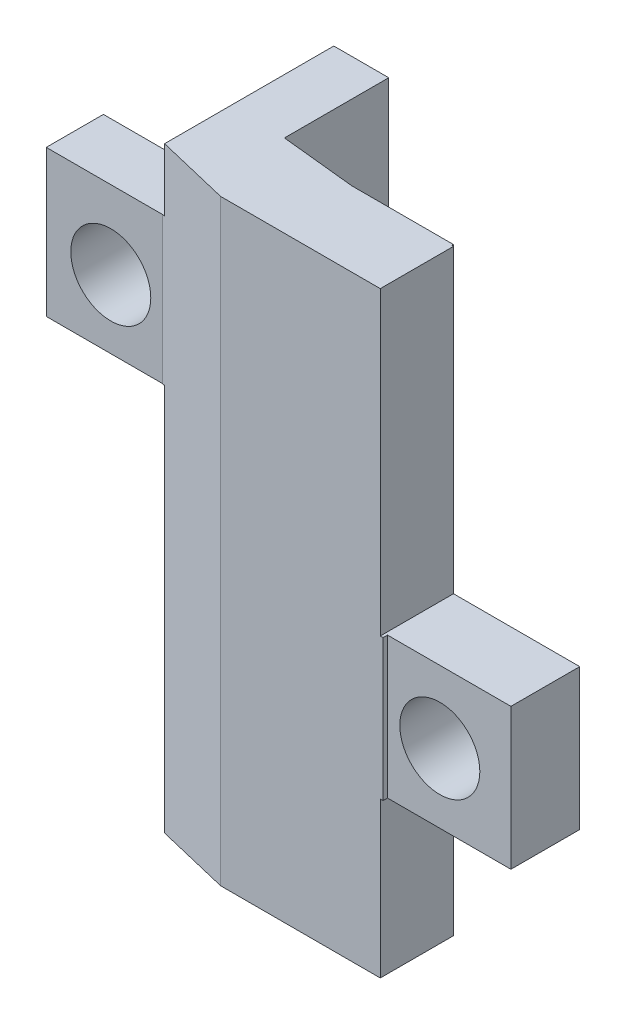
ISO-10303-21;
HEADER;
FILE_DESCRIPTION(('STEP AP214'),'2;1');
FILE_NAME('part.step','',(''),(''),'','','');
FILE_SCHEMA(('AUTOMOTIVE_DESIGN { 1 0 10303 214 1 1 1 1 }'));
ENDSEC;
DATA;
#1=APPLICATION_CONTEXT('core data for automotive mechanical design processes');
#2=APPLICATION_PROTOCOL_DEFINITION('international standard','automotive_design',2000,#1);
#3=PRODUCT_CONTEXT('',#1,'mechanical');
#4=PRODUCT('Part','Part','',(#3));
#5=PRODUCT_RELATED_PRODUCT_CATEGORY('part','',(#4));
#6=PRODUCT_DEFINITION_FORMATION('','',#4);
#7=PRODUCT_DEFINITION_CONTEXT('part definition',#1,'design');
#8=PRODUCT_DEFINITION('design','',#6,#7);
#9=PRODUCT_DEFINITION_SHAPE('','',#8);
#10=(LENGTH_UNIT() NAMED_UNIT(*) SI_UNIT(.MILLI.,.METRE.));
#11=(NAMED_UNIT(*) PLANE_ANGLE_UNIT() SI_UNIT($,.RADIAN.));
#12=(NAMED_UNIT(*) SI_UNIT($,.STERADIAN.) SOLID_ANGLE_UNIT());
#13=UNCERTAINTY_MEASURE_WITH_UNIT(LENGTH_MEASURE(1.E-05),#10,'distance_accuracy_value','');
#14=(GEOMETRIC_REPRESENTATION_CONTEXT(3) GLOBAL_UNCERTAINTY_ASSIGNED_CONTEXT((#13)) GLOBAL_UNIT_ASSIGNED_CONTEXT((#10,
#11,#12)) REPRESENTATION_CONTEXT('',''));
#15=CARTESIAN_POINT('',(0.,0.,0.));
#16=DIRECTION('',(0.,0.,1.));
#17=DIRECTION('',(1.,0.,0.));
#18=AXIS2_PLACEMENT_3D('',#15,#16,#17);
#19=CARTESIAN_POINT('',(44.1667326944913,-18.8400478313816,18.1256266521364));
#20=DIRECTION('',(-0.000195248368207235,0.,0.999999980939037));
#21=DIRECTION('',(0.999999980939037,0.,0.000195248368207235));
#22=AXIS2_PLACEMENT_3D('',#19,#20,#21);
#23=CYLINDRICAL_SURFACE('',#22,1.39999999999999);
#24=CARTESIAN_POINT('',(44.1640294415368,-18.8400478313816,31.970827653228));
#25=DIRECTION('',(0.,0.,-1.));
#26=DIRECTION('',(-1.,0.,0.));
#27=AXIS2_PLACEMENT_3D('',#24,#25,#26);
#28=ELLIPSE('',#27,1.40000002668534,1.39999999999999);
#29=CARTESIAN_POINT('',(42.7640294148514,-18.8400478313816,31.970827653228));
#30=VERTEX_POINT('',#29);
#31=EDGE_CURVE('E352',#30,#30,#28,.T.);
#32=ORIENTED_EDGE('',*,*,#31,.F.);
#33=EDGE_LOOP('',(#32));
#34=FACE_BOUND('',#33,.T.);
#35=CARTESIAN_POINT('',(44.1644998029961,-18.8400478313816,29.5617860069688));
#36=DIRECTION('',(0.,0.,-1.));
#37=DIRECTION('',(-1.,0.,0.));
#38=AXIS2_PLACEMENT_3D('',#35,#36,#37);
#39=ELLIPSE('',#38,1.40000002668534,1.39999999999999);
#40=CARTESIAN_POINT('',(42.7644997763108,-18.8400478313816,29.5617860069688));
#41=VERTEX_POINT('',#40);
#42=EDGE_CURVE('E222',#41,#41,#39,.F.);
#43=ORIENTED_EDGE('',*,*,#42,.F.);
#44=EDGE_LOOP('',(#43));
#45=FACE_BOUND('',#44,.T.);
#46=ADVANCED_FACE('F39',(#34,#45),#23,.F.);
#47=CARTESIAN_POINT('',(42.2362085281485,-16.3206117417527,18.1252497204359));
#48=DIRECTION('',(0.,1.,0.));
#49=DIRECTION('',(0.,0.,1.));
#50=AXIS2_PLACEMENT_3D('',#47,#48,#49);
#51=PLANE('',#50);
#52=DIRECTION('',(-0.000195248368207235,0.,0.999999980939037));
#53=VECTOR('',#52,1.);
#54=CARTESIAN_POINT('',(46.6549716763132,-16.3206117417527,18.1261124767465));
#55=LINE('',#54,#53);
#56=CARTESIAN_POINT('',(46.6527388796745,-16.3206117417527,29.5617860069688));
#57=VERTEX_POINT('',#56);
#58=CARTESIAN_POINT('',(46.6522685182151,-16.3206117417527,31.970827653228));
#59=VERTEX_POINT('',#58);
#60=EDGE_CURVE('E345',#57,#59,#55,.T.);
#61=ORIENTED_EDGE('',*,*,#60,.F.);
#62=DIRECTION('',(-1.,0.,0.));
#63=VECTOR('',#62,1.);
#64=CARTESIAN_POINT('',(42.2362085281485,-16.3206117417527,29.5617860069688));
#65=LINE('',#64,#63);
#66=CARTESIAN_POINT('',(42.233975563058,-16.3206117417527,29.5617860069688));
#67=VERTEX_POINT('',#66);
#68=EDGE_CURVE('E428',#57,#67,#65,.T.);
#69=ORIENTED_EDGE('',*,*,#68,.T.);
#70=DIRECTION('',(-0.000195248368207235,0.,0.999999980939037));
#71=VECTOR('',#70,1.);
#72=CARTESIAN_POINT('',(42.2362085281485,-16.3206117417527,18.1252497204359));
#73=LINE('',#72,#71);
#74=CARTESIAN_POINT('',(42.2334750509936,-16.3206117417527,32.1252494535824));
#75=VERTEX_POINT('',#74);
#76=EDGE_CURVE('E246',#67,#75,#73,.T.);
#77=ORIENTED_EDGE('',*,*,#76,.T.);
#78=DIRECTION('',(-0.999999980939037,0.,-0.000195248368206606));
#79=VECTOR('',#78,1.);
#80=CARTESIAN_POINT('',(42.2334750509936,-16.3206117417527,32.1252494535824));
#81=LINE('',#80,#79);
#82=CARTESIAN_POINT('',(42.3320097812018,-16.3206117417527,32.1252686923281));
#83=VERTEX_POINT('',#82);
#84=EDGE_CURVE('E331',#83,#75,#81,.T.);
#85=ORIENTED_EDGE('',*,*,#84,.F.);
#86=DIRECTION('',(0.000195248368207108,0.,-0.999999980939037));
#87=VECTOR('',#86,1.);
#88=CARTESIAN_POINT('',(42.3320097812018,-16.3206117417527,32.1252686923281));
#89=LINE('',#88,#87);
#90=CARTESIAN_POINT('',(42.3320399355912,-16.3206117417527,31.9708275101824));
#91=VERTEX_POINT('',#90);
#92=EDGE_CURVE('E330',#91,#83,#89,.F.);
#93=ORIENTED_EDGE('',*,*,#92,.F.);
#94=DIRECTION('',(1.,0.,0.));
#95=VECTOR('',#94,1.);
#96=CARTESIAN_POINT('',(19.0773881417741,-16.3206117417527,31.970827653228));
#97=LINE('',#96,#95);
#98=EDGE_CURVE('E353',#91,#59,#97,.T.);
#99=ORIENTED_EDGE('',*,*,#98,.T.);
#100=EDGE_LOOP('',(#61,#69,#77,#85,#93,#99));
#101=FACE_BOUND('',#100,.T.);
#102=ADVANCED_FACE('F438',(#101),#51,.T.);
#103=CARTESIAN_POINT('',(42.2362085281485,-21.2611483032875,18.1252497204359));
#104=DIRECTION('',(0.,-1.,0.));
#105=DIRECTION('',(0.,0.,-1.));
#106=AXIS2_PLACEMENT_3D('',#103,#104,#105);
#107=PLANE('',#106);
#108=DIRECTION('',(-0.000195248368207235,0.,0.999999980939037));
#109=VECTOR('',#108,1.);
#110=CARTESIAN_POINT('',(42.2362085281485,-21.2611483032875,18.1252497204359));
#111=LINE('',#110,#109);
#112=CARTESIAN_POINT('',(42.233975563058,-21.2611483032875,29.5617860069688));
#113=VERTEX_POINT('',#112);
#114=CARTESIAN_POINT('',(42.2334750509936,-21.2611483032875,32.1252494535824));
#115=VERTEX_POINT('',#114);
#116=EDGE_CURVE('E316',#113,#115,#111,.T.);
#117=ORIENTED_EDGE('',*,*,#116,.F.);
#118=DIRECTION('',(1.,0.,0.));
#119=VECTOR('',#118,1.);
#120=CARTESIAN_POINT('',(42.2362085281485,-21.2611483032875,29.5617860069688));
#121=LINE('',#120,#119);
#122=CARTESIAN_POINT('',(46.6527388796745,-21.2611483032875,29.5617860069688));
#123=VERTEX_POINT('',#122);
#124=EDGE_CURVE('E62',#113,#123,#121,.T.);
#125=ORIENTED_EDGE('',*,*,#124,.T.);
#126=DIRECTION('',(-0.000195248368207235,0.,0.999999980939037));
#127=VECTOR('',#126,1.);
#128=CARTESIAN_POINT('',(46.6549716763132,-21.2611483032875,18.1261124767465));
#129=LINE('',#128,#127);
#130=CARTESIAN_POINT('',(46.6522685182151,-21.2611483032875,31.970827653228));
#131=VERTEX_POINT('',#130);
#132=EDGE_CURVE('E318',#123,#131,#129,.T.);
#133=ORIENTED_EDGE('',*,*,#132,.T.);
#134=DIRECTION('',(-1.,0.,0.));
#135=VECTOR('',#134,1.);
#136=CARTESIAN_POINT('',(19.0773881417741,-21.2611483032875,31.970827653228));
#137=LINE('',#136,#135);
#138=CARTESIAN_POINT('',(42.3320399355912,-21.2611483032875,31.9708275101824));
#139=VERTEX_POINT('',#138);
#140=EDGE_CURVE('E347',#131,#139,#137,.T.);
#141=ORIENTED_EDGE('',*,*,#140,.T.);
#142=DIRECTION('',(0.000195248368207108,0.,-0.999999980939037));
#143=VECTOR('',#142,1.);
#144=CARTESIAN_POINT('',(42.3320097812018,-21.2611483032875,32.1252686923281));
#145=LINE('',#144,#143);
#146=CARTESIAN_POINT('',(42.3320097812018,-21.2611483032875,32.1252686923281));
#147=VERTEX_POINT('',#146);
#148=EDGE_CURVE('E283',#147,#139,#145,.T.);
#149=ORIENTED_EDGE('',*,*,#148,.F.);
#150=DIRECTION('',(0.999999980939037,0.,0.000195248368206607));
#151=VECTOR('',#150,1.);
#152=CARTESIAN_POINT('',(42.2334750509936,-21.2611483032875,32.1252494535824));
#153=LINE('',#152,#151);
#154=EDGE_CURVE('E334',#115,#147,#153,.T.);
#155=ORIENTED_EDGE('',*,*,#154,.F.);
#156=EDGE_LOOP('',(#117,#125,#133,#141,#149,#155));
#157=FACE_BOUND('',#156,.T.);
#158=ADVANCED_FACE('F443',(#157),#107,.T.);
#159=CARTESIAN_POINT('',(46.6549716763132,-16.3206117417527,18.1261124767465));
#160=DIRECTION('',(0.999999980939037,0.,0.000195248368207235));
#161=DIRECTION('',(0.000195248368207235,0.,-0.999999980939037));
#162=AXIS2_PLACEMENT_3D('',#159,#160,#161);
#163=PLANE('',#162);
#164=ORIENTED_EDGE('',*,*,#132,.F.);
#165=DIRECTION('',(0.,1.,0.));
#166=VECTOR('',#165,1.);
#167=CARTESIAN_POINT('',(46.6527388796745,-16.3206117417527,29.5617860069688));
#168=LINE('',#167,#166);
#169=EDGE_CURVE('E431',#123,#57,#168,.T.);
#170=ORIENTED_EDGE('',*,*,#169,.T.);
#171=ORIENTED_EDGE('',*,*,#60,.T.);
#172=DIRECTION('',(0.,-1.,0.));
#173=VECTOR('',#172,1.);
#174=CARTESIAN_POINT('',(46.6522685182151,2.,31.970827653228));
#175=LINE('',#174,#173);
#176=EDGE_CURVE('E349',#59,#131,#175,.T.);
#177=ORIENTED_EDGE('',*,*,#176,.T.);
#178=EDGE_LOOP('',(#164,#170,#171,#177));
#179=FACE_BOUND('',#178,.T.);
#180=ADVANCED_FACE('F450',(#179),#163,.T.);
#181=CARTESIAN_POINT('',(32.1591811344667,-10.7308342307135,18.1232821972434));
#182=DIRECTION('',(-0.000195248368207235,0.,0.999999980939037));
#183=DIRECTION('',(0.999999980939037,0.,0.000195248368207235));
#184=AXIS2_PLACEMENT_3D('',#181,#182,#183);
#185=CYLINDRICAL_SURFACE('',#184,1.4);
#186=CARTESIAN_POINT('',(32.1565728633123,-10.7308342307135,31.4820166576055));
#187=DIRECTION('',(0.,0.,-1.));
#188=DIRECTION('',(-1.,0.,0.));
#189=AXIS2_PLACEMENT_3D('',#186,#187,#188);
#190=ELLIPSE('',#189,1.40000002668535,1.4);
#191=CARTESIAN_POINT('',(30.756572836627,-10.7308342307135,31.4820166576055));
#192=VERTEX_POINT('',#191);
#193=EDGE_CURVE('E235',#192,#192,#190,.T.);
#194=ORIENTED_EDGE('',*,*,#193,.F.);
#195=EDGE_LOOP('',(#194));
#196=FACE_BOUND('',#195,.T.);
#197=CARTESIAN_POINT('',(32.1569633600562,-10.7308342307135,29.4820166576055));
#198=DIRECTION('',(0.,0.,-1.));
#199=DIRECTION('',(-1.,0.,0.));
#200=AXIS2_PLACEMENT_3D('',#197,#198,#199);
#201=ELLIPSE('',#200,1.40000002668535,1.4);
#202=CARTESIAN_POINT('',(30.7569633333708,-10.7308342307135,29.4820166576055));
#203=VERTEX_POINT('',#202);
#204=EDGE_CURVE('E227',#203,#203,#201,.F.);
#205=ORIENTED_EDGE('',*,*,#204,.F.);
#206=EDGE_LOOP('',(#205));
#207=FACE_BOUND('',#206,.T.);
#208=ADVANCED_FACE('F453',(#196,#207),#185,.F.);
#209=CARTESIAN_POINT('',(42.332520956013,-26.6889691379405,29.5071940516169));
#210=DIRECTION('',(0.,0.,1.));
#211=DIRECTION('',(1.,0.,0.));
#212=AXIS2_PLACEMENT_3D('',#209,#210,#211);
#213=PLANE('',#212);
#214=DIRECTION('',(0.,1.,0.));
#215=VECTOR('',#214,1.);
#216=CARTESIAN_POINT('',(42.1725545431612,-26.6889691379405,29.5071940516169));
#217=LINE('',#216,#215);
#218=CARTESIAN_POINT('',(42.1725545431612,-26.6889691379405,29.5071940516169));
#219=VERTEX_POINT('',#218);
#220=CARTESIAN_POINT('',(42.1725545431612,-5.7889691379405,29.5071940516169));
#221=VERTEX_POINT('',#220);
#222=EDGE_CURVE('E218',#219,#221,#217,.T.);
#223=ORIENTED_EDGE('',*,*,#222,.F.);
#224=DIRECTION('',(1.,0.,0.));
#225=VECTOR('',#224,1.);
#226=CARTESIAN_POINT('',(42.332520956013,-26.6889691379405,29.5071940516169));
#227=LINE('',#226,#225);
#228=CARTESIAN_POINT('',(38.6182492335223,-26.6889691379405,29.5071940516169));
#229=VERTEX_POINT('',#228);
#230=EDGE_CURVE('E216',#229,#219,#227,.T.);
#231=ORIENTED_EDGE('',*,*,#230,.F.);
#232=DIRECTION('',(0.,1.,0.));
#233=VECTOR('',#232,1.);
#234=CARTESIAN_POINT('',(38.6182492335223,-26.6889691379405,29.5071940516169));
#235=LINE('',#234,#233);
#236=CARTESIAN_POINT('',(38.6182492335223,-5.7889691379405,29.5071940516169));
#237=VERTEX_POINT('',#236);
#238=EDGE_CURVE('E267',#229,#237,#235,.T.);
#239=ORIENTED_EDGE('',*,*,#238,.T.);
#240=DIRECTION('',(-1.,0.,0.));
#241=VECTOR('',#240,1.);
#242=CARTESIAN_POINT('',(42.332520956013,-5.7889691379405,29.5071940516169));
#243=LINE('',#242,#241);
#244=EDGE_CURVE('E242',#221,#237,#243,.T.);
#245=ORIENTED_EDGE('',*,*,#244,.F.);
#246=EDGE_LOOP('',(#223,#231,#239,#245));
#247=FACE_BOUND('',#246,.T.);
#248=ADVANCED_FACE('F460',(#247),#213,.F.);
#249=CARTESIAN_POINT('',(0.,-26.6889691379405,0.));
#250=DIRECTION('',(0.,-1.,0.));
#251=DIRECTION('',(0.,0.,-1.));
#252=AXIS2_PLACEMENT_3D('',#249,#250,#251);
#253=PLANE('',#252);
#254=DIRECTION('',(0.,0.,1.));
#255=VECTOR('',#254,1.);
#256=CARTESIAN_POINT('',(42.1725545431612,-26.6889691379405,0.));
#257=LINE('',#256,#255);
#258=CARTESIAN_POINT('',(42.1725545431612,-26.6889691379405,29.5617860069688));
#259=VERTEX_POINT('',#258);
#260=EDGE_CURVE('E208',#219,#259,#257,.T.);
#261=ORIENTED_EDGE('',*,*,#260,.T.);
#262=DIRECTION('',(1.,0.,0.));
#263=VECTOR('',#262,1.);
#264=CARTESIAN_POINT('',(0.,-26.6889691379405,29.5617860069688));
#265=LINE('',#264,#263);
#266=CARTESIAN_POINT('',(42.233975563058,-26.6889691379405,29.5617860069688));
#267=VERTEX_POINT('',#266);
#268=EDGE_CURVE('E194',#259,#267,#265,.T.);
#269=ORIENTED_EDGE('',*,*,#268,.T.);
#270=DIRECTION('',(-0.000195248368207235,0.,0.999999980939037));
#271=VECTOR('',#270,1.);
#272=CARTESIAN_POINT('',(42.2397458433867,-26.6889691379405,0.00824724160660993));
#273=LINE('',#272,#271);
#274=CARTESIAN_POINT('',(42.2334750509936,-26.6889691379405,32.1252494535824));
#275=VERTEX_POINT('',#274);
#276=EDGE_CURVE('E266',#267,#275,#273,.T.);
#277=ORIENTED_EDGE('',*,*,#276,.T.);
#278=DIRECTION('',(-0.999999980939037,0.,-0.000195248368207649));
#279=VECTOR('',#278,1.);
#280=CARTESIAN_POINT('',(36.642452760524,-26.6889691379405,32.1241578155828));
#281=LINE('',#280,#279);
#282=CARTESIAN_POINT('',(36.642452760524,-26.6889691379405,32.1241578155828));
#283=VERTEX_POINT('',#282);
#284=EDGE_CURVE('E268',#275,#283,#281,.T.);
#285=ORIENTED_EDGE('',*,*,#284,.T.);
#286=DIRECTION('',(-0.972444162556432,0.,-0.23313590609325));
#287=VECTOR('',#286,1.);
#288=CARTESIAN_POINT('',(36.642452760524,-26.6889691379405,32.1241578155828));
#289=LINE('',#288,#287);
#290=CARTESIAN_POINT('',(34.0639828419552,-26.6889691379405,31.5059897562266));
#291=VERTEX_POINT('',#290);
#292=EDGE_CURVE('E270',#283,#291,#289,.T.);
#293=ORIENTED_EDGE('',*,*,#292,.T.);
#294=DIRECTION('',(0.000195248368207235,0.,-0.999999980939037));
#295=VECTOR('',#294,1.);
#296=CARTESIAN_POINT('',(34.070133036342,-26.6889691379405,0.00665213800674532));
#297=LINE('',#296,#295);
#298=CARTESIAN_POINT('',(34.0651392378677,-26.6889691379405,25.5832980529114));
#299=VERTEX_POINT('',#298);
#300=EDGE_CURVE('E273',#291,#299,#297,.T.);
#301=ORIENTED_EDGE('',*,*,#300,.T.);
#302=DIRECTION('',(1.,0.,0.));
#303=VECTOR('',#302,1.);
#304=CARTESIAN_POINT('',(27.9454818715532,-26.6889691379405,25.5832980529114));
#305=LINE('',#304,#303);
#306=CARTESIAN_POINT('',(35.9883722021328,-26.6889691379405,25.5832980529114));
#307=VERTEX_POINT('',#306);
#308=EDGE_CURVE('E262',#299,#307,#305,.T.);
#309=ORIENTED_EDGE('',*,*,#308,.T.);
#310=DIRECTION('',(0.,0.,1.));
#311=VECTOR('',#310,1.);
#312=CARTESIAN_POINT('',(35.9883722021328,-26.6889691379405,29.2344932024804));
#313=LINE('',#312,#311);
#314=CARTESIAN_POINT('',(35.9883722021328,-26.6889691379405,29.2344932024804));
#315=VERTEX_POINT('',#314);
#316=EDGE_CURVE('E259',#307,#315,#313,.T.);
#317=ORIENTED_EDGE('',*,*,#316,.T.);
#318=DIRECTION('',(0.994666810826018,0.,0.103140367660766));
#319=VECTOR('',#318,1.);
#320=CARTESIAN_POINT('',(38.6182492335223,-26.6889691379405,29.5071940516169));
#321=LINE('',#320,#319);
#322=EDGE_CURVE('E261',#315,#229,#321,.T.);
#323=ORIENTED_EDGE('',*,*,#322,.T.);
#324=ORIENTED_EDGE('',*,*,#230,.T.);
#325=EDGE_LOOP('',(#261,#269,#277,#285,#293,#301,#309,#317,#323,#324));
#326=FACE_BOUND('',#325,.T.);
#327=ADVANCED_FACE('F214',(#326),#253,.T.);
#328=CARTESIAN_POINT('',(27.9454818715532,-26.6889691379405,25.5832980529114));
#329=DIRECTION('',(0.,0.,1.));
#330=DIRECTION('',(1.,0.,0.));
#331=AXIS2_PLACEMENT_3D('',#328,#329,#330);
#332=PLANE('',#331);
#333=DIRECTION('',(0.,-1.,0.));
#334=VECTOR('',#333,1.);
#335=CARTESIAN_POINT('',(34.0604800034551,-26.6889691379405,25.5832980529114));
#336=LINE('',#335,#334);
#337=CARTESIAN_POINT('',(34.0604800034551,-7.99601376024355,25.5832980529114));
#338=VERTEX_POINT('',#337);
#339=CARTESIAN_POINT('',(34.0604800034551,-13.1222445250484,25.5832980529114));
#340=VERTEX_POINT('',#339);
#341=EDGE_CURVE('E230',#338,#340,#336,.T.);
#342=ORIENTED_EDGE('',*,*,#341,.F.);
#343=DIRECTION('',(-1.,0.,0.));
#344=VECTOR('',#343,1.);
#345=CARTESIAN_POINT('',(27.9454818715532,-7.99601376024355,25.5832980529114));
#346=LINE('',#345,#344);
#347=CARTESIAN_POINT('',(34.0651392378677,-7.99601376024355,25.5832980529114));
#348=VERTEX_POINT('',#347);
#349=EDGE_CURVE('E299',#348,#338,#346,.T.);
#350=ORIENTED_EDGE('',*,*,#349,.F.);
#351=DIRECTION('',(0.,-1.,0.));
#352=VECTOR('',#351,1.);
#353=CARTESIAN_POINT('',(34.0651392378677,-26.6889691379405,25.5832980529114));
#354=LINE('',#353,#352);
#355=CARTESIAN_POINT('',(34.0651392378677,-5.7889691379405,25.5832980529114));
#356=VERTEX_POINT('',#355);
#357=EDGE_CURVE('E288',#356,#348,#354,.T.);
#358=ORIENTED_EDGE('',*,*,#357,.F.);
#359=DIRECTION('',(-1.,0.,0.));
#360=VECTOR('',#359,1.);
#361=CARTESIAN_POINT('',(27.9454818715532,-5.7889691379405,25.5832980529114));
#362=LINE('',#361,#360);
#363=CARTESIAN_POINT('',(35.9883722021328,-5.7889691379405,25.5832980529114));
#364=VERTEX_POINT('',#363);
#365=EDGE_CURVE('E238',#364,#356,#362,.T.);
#366=ORIENTED_EDGE('',*,*,#365,.F.);
#367=DIRECTION('',(0.,1.,0.));
#368=VECTOR('',#367,1.);
#369=CARTESIAN_POINT('',(35.9883722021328,-26.6889691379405,25.5832980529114));
#370=LINE('',#369,#368);
#371=EDGE_CURVE('E282',#307,#364,#370,.T.);
#372=ORIENTED_EDGE('',*,*,#371,.F.);
#373=ORIENTED_EDGE('',*,*,#308,.F.);
#374=DIRECTION('',(0.,-1.,0.));
#375=VECTOR('',#374,1.);
#376=CARTESIAN_POINT('',(34.0651392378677,-26.6889691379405,25.5832980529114));
#377=LINE('',#376,#375);
#378=CARTESIAN_POINT('',(34.0651392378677,-13.1222445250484,25.5832980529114));
#379=VERTEX_POINT('',#378);
#380=EDGE_CURVE('E239',#379,#299,#377,.T.);
#381=ORIENTED_EDGE('',*,*,#380,.F.);
#382=DIRECTION('',(1.,0.,0.));
#383=VECTOR('',#382,1.);
#384=CARTESIAN_POINT('',(27.9454818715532,-13.1222445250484,25.5832980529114));
#385=LINE('',#384,#383);
#386=EDGE_CURVE('E308',#340,#379,#385,.T.);
#387=ORIENTED_EDGE('',*,*,#386,.F.);
#388=EDGE_LOOP('',(#342,#350,#358,#366,#372,#373,#381,#387));
#389=FACE_BOUND('',#388,.T.);
#390=ADVANCED_FACE('F400',(#389),#332,.F.);
#391=CARTESIAN_POINT('',(34.0665957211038,-13.1222445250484,18.123654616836));
#392=DIRECTION('',(0.,-1.,0.));
#393=DIRECTION('',(0.,0.,-1.));
#394=AXIS2_PLACEMENT_3D('',#391,#392,#393);
#395=PLANE('',#394);
#396=DIRECTION('',(1.,0.,0.));
#397=VECTOR('',#396,1.);
#398=CARTESIAN_POINT('',(34.0665957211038,-13.1222445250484,29.4820166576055));
#399=LINE('',#398,#397);
#400=CARTESIAN_POINT('',(29.8983462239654,-13.1222445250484,29.4820166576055));
#401=VERTEX_POINT('',#400);
#402=CARTESIAN_POINT('',(34.0604800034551,-13.1222445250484,29.4820166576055));
#403=VERTEX_POINT('',#402);
#404=EDGE_CURVE('E54',#401,#403,#399,.T.);
#405=ORIENTED_EDGE('',*,*,#404,.T.);
#406=DIRECTION('',(0.,0.,-1.));
#407=VECTOR('',#406,1.);
#408=CARTESIAN_POINT('',(34.0604800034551,-13.1222445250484,18.123654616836));
#409=LINE('',#408,#407);
#410=EDGE_CURVE('E232',#403,#340,#409,.T.);
#411=ORIENTED_EDGE('',*,*,#410,.T.);
#412=ORIENTED_EDGE('',*,*,#386,.T.);
#413=DIRECTION('',(-0.000195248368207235,0.,0.999999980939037));
#414=VECTOR('',#413,1.);
#415=CARTESIAN_POINT('',(34.0665957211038,-13.1222445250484,18.123654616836));
#416=LINE('',#415,#414);
#417=CARTESIAN_POINT('',(34.0639828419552,-13.1222445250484,31.5059897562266));
#418=VERTEX_POINT('',#417);
#419=EDGE_CURVE('E302',#379,#418,#416,.T.);
#420=ORIENTED_EDGE('',*,*,#419,.T.);
#421=DIRECTION('',(-0.972444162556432,0.,-0.23313590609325));
#422=VECTOR('',#421,1.);
#423=CARTESIAN_POINT('',(36.642452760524,-13.1222445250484,32.1241578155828));
#424=LINE('',#423,#422);
#425=CARTESIAN_POINT('',(33.9639875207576,-13.1222445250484,31.4820166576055));
#426=VERTEX_POINT('',#425);
#427=EDGE_CURVE('E286',#418,#426,#424,.T.);
#428=ORIENTED_EDGE('',*,*,#427,.T.);
#429=DIRECTION('',(-1.,0.,0.));
#430=VECTOR('',#429,1.);
#431=CARTESIAN_POINT('',(26.6784024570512,-13.1222445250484,31.4820166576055));
#432=LINE('',#431,#430);
#433=CARTESIAN_POINT('',(29.8979557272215,-13.1222445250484,31.4820166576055));
#434=VERTEX_POINT('',#433);
#435=EDGE_CURVE('E305',#426,#434,#432,.T.);
#436=ORIENTED_EDGE('',*,*,#435,.T.);
#437=DIRECTION('',(-0.000195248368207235,0.,0.999999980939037));
#438=VECTOR('',#437,1.);
#439=CARTESIAN_POINT('',(29.9005640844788,-13.1222445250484,18.1228412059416));
#440=LINE('',#439,#438);
#441=EDGE_CURVE('E251',#401,#434,#440,.T.);
#442=ORIENTED_EDGE('',*,*,#441,.F.);
#443=EDGE_LOOP('',(#405,#411,#412,#420,#428,#436,#442));
#444=FACE_BOUND('',#443,.T.);
#445=ADVANCED_FACE('F370',(#444),#395,.T.);
#446=CARTESIAN_POINT('',(34.0665957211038,-7.99601376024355,18.123654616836));
#447=DIRECTION('',(0.,1.,0.));
#448=DIRECTION('',(0.,0.,1.));
#449=AXIS2_PLACEMENT_3D('',#446,#447,#448);
#450=PLANE('',#449);
#451=ORIENTED_EDGE('',*,*,#349,.T.);
#452=DIRECTION('',(0.,0.,1.));
#453=VECTOR('',#452,1.);
#454=CARTESIAN_POINT('',(34.0604800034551,-7.99601376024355,18.123654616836));
#455=LINE('',#454,#453);
#456=CARTESIAN_POINT('',(34.0604800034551,-7.99601376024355,29.4820166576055));
#457=VERTEX_POINT('',#456);
#458=EDGE_CURVE('E11',#338,#457,#455,.T.);
#459=ORIENTED_EDGE('',*,*,#458,.T.);
#460=DIRECTION('',(-1.,0.,0.));
#461=VECTOR('',#460,1.);
#462=CARTESIAN_POINT('',(34.0665957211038,-7.99601376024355,29.4820166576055));
#463=LINE('',#462,#461);
#464=CARTESIAN_POINT('',(29.8983462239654,-7.99601376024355,29.4820166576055));
#465=VERTEX_POINT('',#464);
#466=EDGE_CURVE('E217',#457,#465,#463,.T.);
#467=ORIENTED_EDGE('',*,*,#466,.T.);
#468=DIRECTION('',(-0.000195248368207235,0.,0.999999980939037));
#469=VECTOR('',#468,1.);
#470=CARTESIAN_POINT('',(29.9005640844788,-7.99601376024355,18.1228412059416));
#471=LINE('',#470,#469);
#472=CARTESIAN_POINT('',(29.8979557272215,-7.99601376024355,31.4820166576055));
#473=VERTEX_POINT('',#472);
#474=EDGE_CURVE('E255',#465,#473,#471,.T.);
#475=ORIENTED_EDGE('',*,*,#474,.T.);
#476=DIRECTION('',(1.,0.,0.));
#477=VECTOR('',#476,1.);
#478=CARTESIAN_POINT('',(26.6784024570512,-7.99601376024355,31.4820166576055));
#479=LINE('',#478,#477);
#480=CARTESIAN_POINT('',(33.9639875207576,-7.99601376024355,31.4820166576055));
#481=VERTEX_POINT('',#480);
#482=EDGE_CURVE('E252',#473,#481,#479,.T.);
#483=ORIENTED_EDGE('',*,*,#482,.T.);
#484=DIRECTION('',(0.972444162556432,0.,0.23313590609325));
#485=VECTOR('',#484,1.);
#486=CARTESIAN_POINT('',(36.642452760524,-7.99601376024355,32.1241578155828));
#487=LINE('',#486,#485);
#488=CARTESIAN_POINT('',(34.0639828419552,-7.99601376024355,31.5059897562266));
#489=VERTEX_POINT('',#488);
#490=EDGE_CURVE('E254',#481,#489,#487,.T.);
#491=ORIENTED_EDGE('',*,*,#490,.T.);
#492=DIRECTION('',(-0.000195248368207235,0.,0.999999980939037));
#493=VECTOR('',#492,1.);
#494=CARTESIAN_POINT('',(34.0665957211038,-7.99601376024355,18.123654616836));
#495=LINE('',#494,#493);
#496=EDGE_CURVE('E247',#348,#489,#495,.T.);
#497=ORIENTED_EDGE('',*,*,#496,.F.);
#498=EDGE_LOOP('',(#451,#459,#467,#475,#483,#491,#497));
#499=FACE_BOUND('',#498,.T.);
#500=ADVANCED_FACE('F380',(#499),#450,.T.);
#501=CARTESIAN_POINT('',(29.9005640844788,-7.99601376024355,18.1228412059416));
#502=DIRECTION('',(-0.999999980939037,0.,-0.000195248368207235));
#503=DIRECTION('',(-0.000195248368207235,0.,0.999999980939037));
#504=AXIS2_PLACEMENT_3D('',#501,#502,#503);
#505=PLANE('',#504);
#506=ORIENTED_EDGE('',*,*,#474,.F.);
#507=DIRECTION('',(0.,-1.,0.));
#508=VECTOR('',#507,1.);
#509=CARTESIAN_POINT('',(29.8983462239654,-7.99601376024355,29.4820166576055));
#510=LINE('',#509,#508);
#511=EDGE_CURVE('E47',#465,#401,#510,.T.);
#512=ORIENTED_EDGE('',*,*,#511,.T.);
#513=ORIENTED_EDGE('',*,*,#441,.T.);
#514=DIRECTION('',(0.,1.,0.));
#515=VECTOR('',#514,1.);
#516=CARTESIAN_POINT('',(29.8979557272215,-26.6889691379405,31.4820166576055));
#517=LINE('',#516,#515);
#518=EDGE_CURVE('E248',#434,#473,#517,.T.);
#519=ORIENTED_EDGE('',*,*,#518,.T.);
#520=EDGE_LOOP('',(#506,#512,#513,#519));
#521=FACE_BOUND('',#520,.T.);
#522=ADVANCED_FACE('F368',(#521),#505,.T.);
#523=CARTESIAN_POINT('',(34.0665957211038,-5.7889691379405,18.123654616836));
#524=DIRECTION('',(0.,1.,0.));
#525=DIRECTION('',(0.,0.,1.));
#526=AXIS2_PLACEMENT_3D('',#523,#524,#525);
#527=PLANE('',#526);
#528=DIRECTION('',(-0.000195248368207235,0.,0.999999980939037));
#529=VECTOR('',#528,1.);
#530=CARTESIAN_POINT('',(42.2362085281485,-5.7889691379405,18.1252497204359));
#531=LINE('',#530,#529);
#532=CARTESIAN_POINT('',(42.233975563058,-5.7889691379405,29.5617860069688));
#533=VERTEX_POINT('',#532);
#534=CARTESIAN_POINT('',(42.2334750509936,-5.7889691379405,32.1252494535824));
#535=VERTEX_POINT('',#534);
#536=EDGE_CURVE('E319',#533,#535,#531,.T.);
#537=ORIENTED_EDGE('',*,*,#536,.F.);
#538=DIRECTION('',(-1.,0.,0.));
#539=VECTOR('',#538,1.);
#540=CARTESIAN_POINT('',(34.0665957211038,-5.7889691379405,29.5617860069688));
#541=LINE('',#540,#539);
#542=CARTESIAN_POINT('',(42.1725545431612,-5.7889691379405,29.5617860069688));
#543=VERTEX_POINT('',#542);
#544=EDGE_CURVE('E421',#533,#543,#541,.T.);
#545=ORIENTED_EDGE('',*,*,#544,.T.);
#546=DIRECTION('',(0.,0.,-1.));
#547=VECTOR('',#546,1.);
#548=CARTESIAN_POINT('',(42.1725545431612,-5.7889691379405,18.123654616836));
#549=LINE('',#548,#547);
#550=EDGE_CURVE('E211',#543,#221,#549,.T.);
#551=ORIENTED_EDGE('',*,*,#550,.T.);
#552=ORIENTED_EDGE('',*,*,#244,.T.);
#553=DIRECTION('',(-0.994666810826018,0.,-0.103140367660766));
#554=VECTOR('',#553,1.);
#555=CARTESIAN_POINT('',(38.6182492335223,-5.7889691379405,29.5071940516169));
#556=LINE('',#555,#554);
#557=CARTESIAN_POINT('',(35.9883722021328,-5.7889691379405,29.2344932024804));
#558=VERTEX_POINT('',#557);
#559=EDGE_CURVE('E293',#237,#558,#556,.T.);
#560=ORIENTED_EDGE('',*,*,#559,.T.);
#561=DIRECTION('',(0.,0.,-1.));
#562=VECTOR('',#561,1.);
#563=CARTESIAN_POINT('',(35.9883722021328,-5.7889691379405,29.2344932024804));
#564=LINE('',#563,#562);
#565=EDGE_CURVE('E290',#558,#364,#564,.T.);
#566=ORIENTED_EDGE('',*,*,#565,.T.);
#567=ORIENTED_EDGE('',*,*,#365,.T.);
#568=DIRECTION('',(-0.000195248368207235,0.,0.999999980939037));
#569=VECTOR('',#568,1.);
#570=CARTESIAN_POINT('',(34.0665957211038,-5.7889691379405,18.123654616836));
#571=LINE('',#570,#569);
#572=CARTESIAN_POINT('',(34.0639828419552,-5.7889691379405,31.5059897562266));
#573=VERTEX_POINT('',#572);
#574=EDGE_CURVE('E243',#356,#573,#571,.T.);
#575=ORIENTED_EDGE('',*,*,#574,.T.);
#576=DIRECTION('',(0.972444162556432,0.,0.23313590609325));
#577=VECTOR('',#576,1.);
#578=CARTESIAN_POINT('',(36.642452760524,-5.7889691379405,32.1241578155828));
#579=LINE('',#578,#577);
#580=CARTESIAN_POINT('',(36.642452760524,-5.7889691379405,32.1241578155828));
#581=VERTEX_POINT('',#580);
#582=EDGE_CURVE('E240',#573,#581,#579,.T.);
#583=ORIENTED_EDGE('',*,*,#582,.T.);
#584=DIRECTION('',(-0.999999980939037,0.,-0.000195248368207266));
#585=VECTOR('',#584,1.);
#586=CARTESIAN_POINT('',(34.0638622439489,-5.7889691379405,32.1236543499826));
#587=LINE('',#586,#585);
#588=EDGE_CURVE('E264',#535,#581,#587,.T.);
#589=ORIENTED_EDGE('',*,*,#588,.F.);
#590=EDGE_LOOP('',(#537,#545,#551,#552,#560,#566,#567,#575,#583,#589));
#591=FACE_BOUND('',#590,.T.);
#592=ADVANCED_FACE('F393',(#591),#527,.T.);
#593=CARTESIAN_POINT('',(42.2362085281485,-5.7889691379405,18.1252497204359));
#594=DIRECTION('',(0.999999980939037,0.,0.000195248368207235));
#595=DIRECTION('',(0.000195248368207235,0.,-0.999999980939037));
#596=AXIS2_PLACEMENT_3D('',#593,#594,#595);
#597=PLANE('',#596);
#598=ORIENTED_EDGE('',*,*,#76,.F.);
#599=DIRECTION('',(0.,1.,0.));
#600=VECTOR('',#599,1.);
#601=CARTESIAN_POINT('',(42.233975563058,-5.7889691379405,29.5617860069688));
#602=LINE('',#601,#600);
#603=EDGE_CURVE('E426',#67,#533,#602,.T.);
#604=ORIENTED_EDGE('',*,*,#603,.T.);
#605=ORIENTED_EDGE('',*,*,#536,.T.);
#606=DIRECTION('',(0.,1.,0.));
#607=VECTOR('',#606,1.);
#608=CARTESIAN_POINT('',(42.2334750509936,-5.7889691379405,32.1252494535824));
#609=LINE('',#608,#607);
#610=EDGE_CURVE('E327',#75,#535,#609,.T.);
#611=ORIENTED_EDGE('',*,*,#610,.F.);
#612=EDGE_LOOP('',(#598,#604,#605,#611));
#613=FACE_BOUND('',#612,.T.);
#614=ADVANCED_FACE('F425',(#613),#597,.T.);
#615=CARTESIAN_POINT('',(42.2362085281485,-21.2611483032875,18.1252497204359));
#616=DIRECTION('',(0.999999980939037,0.,0.000195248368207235));
#617=DIRECTION('',(0.000195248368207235,0.,-0.999999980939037));
#618=AXIS2_PLACEMENT_3D('',#615,#616,#617);
#619=PLANE('',#618);
#620=ORIENTED_EDGE('',*,*,#276,.F.);
#621=DIRECTION('',(0.,1.,0.));
#622=VECTOR('',#621,1.);
#623=CARTESIAN_POINT('',(42.233975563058,-21.2611483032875,29.5617860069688));
#624=LINE('',#623,#622);
#625=EDGE_CURVE('E200',#267,#113,#624,.T.);
#626=ORIENTED_EDGE('',*,*,#625,.T.);
#627=ORIENTED_EDGE('',*,*,#116,.T.);
#628=DIRECTION('',(0.,1.,0.));
#629=VECTOR('',#628,1.);
#630=CARTESIAN_POINT('',(42.2334750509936,-21.2611483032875,32.1252494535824));
#631=LINE('',#630,#629);
#632=EDGE_CURVE('E326',#275,#115,#631,.T.);
#633=ORIENTED_EDGE('',*,*,#632,.F.);
#634=EDGE_LOOP('',(#620,#626,#627,#633));
#635=FACE_BOUND('',#634,.T.);
#636=ADVANCED_FACE('F468',(#635),#619,.T.);
#637=CARTESIAN_POINT('',(19.0773881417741,2.,31.970827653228));
#638=DIRECTION('',(0.,0.,-1.));
#639=DIRECTION('',(-1.,0.,0.));
#640=AXIS2_PLACEMENT_3D('',#637,#638,#639);
#641=PLANE('',#640);
#642=ORIENTED_EDGE('',*,*,#31,.T.);
#643=EDGE_LOOP('',(#642));
#644=FACE_BOUND('',#643,.T.);
#645=ORIENTED_EDGE('',*,*,#98,.F.);
#646=DIRECTION('',(0.,1.,0.));
#647=VECTOR('',#646,1.);
#648=CARTESIAN_POINT('',(42.3320399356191,0.,31.9708273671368));
#649=LINE('',#648,#647);
#650=EDGE_CURVE('E356',#139,#91,#649,.T.);
#651=ORIENTED_EDGE('',*,*,#650,.F.);
#652=ORIENTED_EDGE('',*,*,#140,.F.);
#653=ORIENTED_EDGE('',*,*,#176,.F.);
#654=EDGE_LOOP('',(#645,#651,#652,#653));
#655=FACE_BOUND('',#654,.T.);
#656=ADVANCED_FACE('F41',(#644,#655),#641,.F.);
#657=CARTESIAN_POINT('',(26.6784024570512,-26.6889691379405,31.4820166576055));
#658=DIRECTION('',(0.,0.,-1.));
#659=DIRECTION('',(-1.,0.,0.));
#660=AXIS2_PLACEMENT_3D('',#657,#658,#659);
#661=PLANE('',#660);
#662=ORIENTED_EDGE('',*,*,#193,.T.);
#663=EDGE_LOOP('',(#662));
#664=FACE_BOUND('',#663,.T.);
#665=ORIENTED_EDGE('',*,*,#435,.F.);
#666=DIRECTION('',(0.,1.,0.));
#667=VECTOR('',#666,1.);
#668=CARTESIAN_POINT('',(33.9639875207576,-26.6889691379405,31.4820166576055));
#669=LINE('',#668,#667);
#670=EDGE_CURVE('E258',#426,#481,#669,.T.);
#671=ORIENTED_EDGE('',*,*,#670,.T.);
#672=ORIENTED_EDGE('',*,*,#482,.F.);
#673=ORIENTED_EDGE('',*,*,#518,.F.);
#674=EDGE_LOOP('',(#665,#671,#672,#673));
#675=FACE_BOUND('',#674,.T.);
#676=ADVANCED_FACE('F377',(#664,#675),#661,.F.);
#677=CARTESIAN_POINT('',(36.642452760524,-26.6889691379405,32.1241578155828));
#678=DIRECTION('',(0.23313590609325,0.,-0.972444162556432));
#679=DIRECTION('',(-0.972444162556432,0.,-0.23313590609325));
#680=AXIS2_PLACEMENT_3D('',#677,#678,#679);
#681=PLANE('',#680);
#682=DIRECTION('',(0.,1.,0.));
#683=VECTOR('',#682,1.);
#684=CARTESIAN_POINT('',(34.0639828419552,-26.6889691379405,31.5059897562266));
#685=LINE('',#684,#683);
#686=EDGE_CURVE('E236',#291,#418,#685,.T.);
#687=ORIENTED_EDGE('',*,*,#686,.F.);
#688=ORIENTED_EDGE('',*,*,#292,.F.);
#689=DIRECTION('',(0.,1.,0.));
#690=VECTOR('',#689,1.);
#691=CARTESIAN_POINT('',(36.642452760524,-26.6889691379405,32.1241578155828));
#692=LINE('',#691,#690);
#693=EDGE_CURVE('E274',#283,#581,#692,.T.);
#694=ORIENTED_EDGE('',*,*,#693,.T.);
#695=ORIENTED_EDGE('',*,*,#582,.F.);
#696=DIRECTION('',(0.,1.,0.));
#697=VECTOR('',#696,1.);
#698=CARTESIAN_POINT('',(34.0639828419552,-26.6889691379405,31.5059897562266));
#699=LINE('',#698,#697);
#700=EDGE_CURVE('E244',#489,#573,#699,.T.);
#701=ORIENTED_EDGE('',*,*,#700,.F.);
#702=ORIENTED_EDGE('',*,*,#490,.F.);
#703=ORIENTED_EDGE('',*,*,#670,.F.);
#704=ORIENTED_EDGE('',*,*,#427,.F.);
#705=EDGE_LOOP('',(#687,#688,#694,#695,#701,#702,#703,#704));
#706=FACE_BOUND('',#705,.T.);
#707=ADVANCED_FACE('F385',(#706),#681,.F.);
#708=CARTESIAN_POINT('',(-0.00627079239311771,0.,32.1170022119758));
#709=DIRECTION('',(0.000195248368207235,0.,-0.999999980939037));
#710=DIRECTION('',(-0.999999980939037,0.,-0.000195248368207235));
#711=AXIS2_PLACEMENT_3D('',#708,#709,#710);
#712=PLANE('',#711);
#713=ORIENTED_EDGE('',*,*,#588,.T.);
#714=ORIENTED_EDGE('',*,*,#693,.F.);
#715=ORIENTED_EDGE('',*,*,#284,.F.);
#716=ORIENTED_EDGE('',*,*,#632,.T.);
#717=ORIENTED_EDGE('',*,*,#154,.T.);
#718=DIRECTION('',(0.,-1.,0.));
#719=VECTOR('',#718,1.);
#720=CARTESIAN_POINT('',(42.3320097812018,2.,32.1252686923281));
#721=LINE('',#720,#719);
#722=EDGE_CURVE('E340',#83,#147,#721,.T.);
#723=ORIENTED_EDGE('',*,*,#722,.F.);
#724=ORIENTED_EDGE('',*,*,#84,.T.);
#725=ORIENTED_EDGE('',*,*,#610,.T.);
#726=EDGE_LOOP('',(#713,#714,#715,#716,#717,#723,#724,#725));
#727=FACE_BOUND('',#726,.T.);
#728=ADVANCED_FACE('F419',(#727),#712,.F.);
#729=CARTESIAN_POINT('',(42.3320097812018,0.,32.1252686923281));
#730=DIRECTION('',(0.999999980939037,0.,0.000195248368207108));
#731=DIRECTION('',(0.000195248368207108,0.,-0.999999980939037));
#732=AXIS2_PLACEMENT_3D('',#729,#730,#731);
#733=PLANE('',#732);
#734=ORIENTED_EDGE('',*,*,#148,.T.);
#735=ORIENTED_EDGE('',*,*,#650,.T.);
#736=ORIENTED_EDGE('',*,*,#92,.T.);
#737=ORIENTED_EDGE('',*,*,#722,.T.);
#738=EDGE_LOOP('',(#734,#735,#736,#737));
#739=FACE_BOUND('',#738,.T.);
#740=ADVANCED_FACE('F485',(#739),#733,.T.);
#741=CARTESIAN_POINT('',(38.6182492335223,-26.6889691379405,29.5071940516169));
#742=DIRECTION('',(-0.103140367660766,0.,0.994666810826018));
#743=DIRECTION('',(0.994666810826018,0.,0.103140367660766));
#744=AXIS2_PLACEMENT_3D('',#741,#742,#743);
#745=PLANE('',#744);
#746=ORIENTED_EDGE('',*,*,#559,.F.);
#747=ORIENTED_EDGE('',*,*,#238,.F.);
#748=ORIENTED_EDGE('',*,*,#322,.F.);
#749=DIRECTION('',(0.,1.,0.));
#750=VECTOR('',#749,1.);
#751=CARTESIAN_POINT('',(35.9883722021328,-26.6889691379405,29.2344932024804));
#752=LINE('',#751,#750);
#753=EDGE_CURVE('E279',#315,#558,#752,.T.);
#754=ORIENTED_EDGE('',*,*,#753,.T.);
#755=EDGE_LOOP('',(#746,#747,#748,#754));
#756=FACE_BOUND('',#755,.T.);
#757=ADVANCED_FACE('F488',(#756),#745,.F.);
#758=CARTESIAN_POINT('',(35.9883722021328,-26.6889691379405,29.2344932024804));
#759=DIRECTION('',(-1.,0.,0.));
#760=DIRECTION('',(0.,0.,1.));
#761=AXIS2_PLACEMENT_3D('',#758,#759,#760);
#762=PLANE('',#761);
#763=ORIENTED_EDGE('',*,*,#565,.F.);
#764=ORIENTED_EDGE('',*,*,#753,.F.);
#765=ORIENTED_EDGE('',*,*,#316,.F.);
#766=ORIENTED_EDGE('',*,*,#371,.T.);
#767=EDGE_LOOP('',(#763,#764,#765,#766));
#768=FACE_BOUND('',#767,.T.);
#769=ADVANCED_FACE('F405',(#768),#762,.F.);
#770=CARTESIAN_POINT('',(34.0665957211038,-13.1222445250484,18.123654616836));
#771=DIRECTION('',(-0.999999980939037,0.,-0.000195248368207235));
#772=DIRECTION('',(-0.000195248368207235,0.,0.999999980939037));
#773=AXIS2_PLACEMENT_3D('',#770,#771,#772);
#774=PLANE('',#773);
#775=ORIENTED_EDGE('',*,*,#380,.T.);
#776=ORIENTED_EDGE('',*,*,#300,.F.);
#777=ORIENTED_EDGE('',*,*,#686,.T.);
#778=ORIENTED_EDGE('',*,*,#419,.F.);
#779=EDGE_LOOP('',(#775,#776,#777,#778));
#780=FACE_BOUND('',#779,.T.);
#781=ADVANCED_FACE('F413',(#780),#774,.T.);
#782=CARTESIAN_POINT('',(34.0665957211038,-5.7889691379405,18.123654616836));
#783=DIRECTION('',(-0.999999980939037,0.,-0.000195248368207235));
#784=DIRECTION('',(-0.000195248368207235,0.,0.999999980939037));
#785=AXIS2_PLACEMENT_3D('',#782,#783,#784);
#786=PLANE('',#785);
#787=ORIENTED_EDGE('',*,*,#357,.T.);
#788=ORIENTED_EDGE('',*,*,#496,.T.);
#789=ORIENTED_EDGE('',*,*,#700,.T.);
#790=ORIENTED_EDGE('',*,*,#574,.F.);
#791=EDGE_LOOP('',(#787,#788,#789,#790));
#792=FACE_BOUND('',#791,.T.);
#793=ADVANCED_FACE('F389',(#792),#786,.T.);
#794=CARTESIAN_POINT('',(48.327793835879,-27.1222445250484,29.5617860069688));
#795=DIRECTION('',(0.,0.,-1.));
#796=DIRECTION('',(-1.,0.,0.));
#797=AXIS2_PLACEMENT_3D('',#794,#795,#796);
#798=PLANE('',#797);
#799=ORIENTED_EDGE('',*,*,#603,.F.);
#800=ORIENTED_EDGE('',*,*,#68,.F.);
#801=ORIENTED_EDGE('',*,*,#169,.F.);
#802=ORIENTED_EDGE('',*,*,#124,.F.);
#803=ORIENTED_EDGE('',*,*,#625,.F.);
#804=ORIENTED_EDGE('',*,*,#268,.F.);
#805=DIRECTION('',(0.,1.,0.));
#806=VECTOR('',#805,1.);
#807=CARTESIAN_POINT('',(42.1725545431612,-27.1222445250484,29.5617860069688));
#808=LINE('',#807,#806);
#809=EDGE_CURVE('E198',#259,#543,#808,.T.);
#810=ORIENTED_EDGE('',*,*,#809,.T.);
#811=ORIENTED_EDGE('',*,*,#544,.F.);
#812=EDGE_LOOP('',(#799,#800,#801,#802,#803,#804,#810,#811));
#813=FACE_BOUND('',#812,.T.);
#814=ORIENTED_EDGE('',*,*,#42,.T.);
#815=EDGE_LOOP('',(#814));
#816=FACE_BOUND('',#815,.T.);
#817=ADVANCED_FACE('F196',(#813,#816),#798,.T.);
#818=CARTESIAN_POINT('',(42.1725545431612,-27.1222445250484,29.5617860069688));
#819=DIRECTION('',(1.,0.,0.));
#820=DIRECTION('',(0.,0.,-1.));
#821=AXIS2_PLACEMENT_3D('',#818,#819,#820);
#822=PLANE('',#821);
#823=ORIENTED_EDGE('',*,*,#222,.T.);
#824=ORIENTED_EDGE('',*,*,#550,.F.);
#825=ORIENTED_EDGE('',*,*,#809,.F.);
#826=ORIENTED_EDGE('',*,*,#260,.F.);
#827=EDGE_LOOP('',(#823,#824,#825,#826));
#828=FACE_BOUND('',#827,.T.);
#829=ADVANCED_FACE('F207',(#828),#822,.T.);
#830=CARTESIAN_POINT('',(28.9083944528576,-27.1222445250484,29.4820166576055));
#831=DIRECTION('',(0.,0.,-1.));
#832=DIRECTION('',(-1.,0.,0.));
#833=AXIS2_PLACEMENT_3D('',#830,#831,#832);
#834=PLANE('',#833);
#835=ORIENTED_EDGE('',*,*,#511,.F.);
#836=ORIENTED_EDGE('',*,*,#466,.F.);
#837=DIRECTION('',(0.,1.,0.));
#838=VECTOR('',#837,1.);
#839=CARTESIAN_POINT('',(34.0604800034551,-27.1222445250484,29.4820166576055));
#840=LINE('',#839,#838);
#841=EDGE_CURVE('E204',#403,#457,#840,.T.);
#842=ORIENTED_EDGE('',*,*,#841,.F.);
#843=ORIENTED_EDGE('',*,*,#404,.F.);
#844=EDGE_LOOP('',(#835,#836,#842,#843));
#845=FACE_BOUND('',#844,.T.);
#846=ORIENTED_EDGE('',*,*,#204,.T.);
#847=EDGE_LOOP('',(#846));
#848=FACE_BOUND('',#847,.T.);
#849=ADVANCED_FACE('F506',(#845,#848),#834,.T.);
#850=CARTESIAN_POINT('',(34.0604800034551,-27.1222445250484,29.4820166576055));
#851=DIRECTION('',(-1.,0.,0.));
#852=DIRECTION('',(0.,0.,1.));
#853=AXIS2_PLACEMENT_3D('',#850,#851,#852);
#854=PLANE('',#853);
#855=ORIENTED_EDGE('',*,*,#841,.T.);
#856=ORIENTED_EDGE('',*,*,#458,.F.);
#857=ORIENTED_EDGE('',*,*,#341,.T.);
#858=ORIENTED_EDGE('',*,*,#410,.F.);
#859=EDGE_LOOP('',(#855,#856,#857,#858));
#860=FACE_BOUND('',#859,.T.);
#861=ADVANCED_FACE('F507',(#860),#854,.T.);
#862=CLOSED_SHELL('',(#46,#102,#158,#180,#208,#248,#327,#390,#445,#500,#522,#592,#614,#636,#656,
#676,#707,#728,#740,#757,#769,#781,#793,#817,#829,#849,#861));
#863=MANIFOLD_SOLID_BREP('B2',#862);
#864=ADVANCED_BREP_SHAPE_REPRESENTATION('',(#18,#863),#14);
#865=SHAPE_DEFINITION_REPRESENTATION(#9,#864);
ENDSEC;
END-ISO-10303-21;
